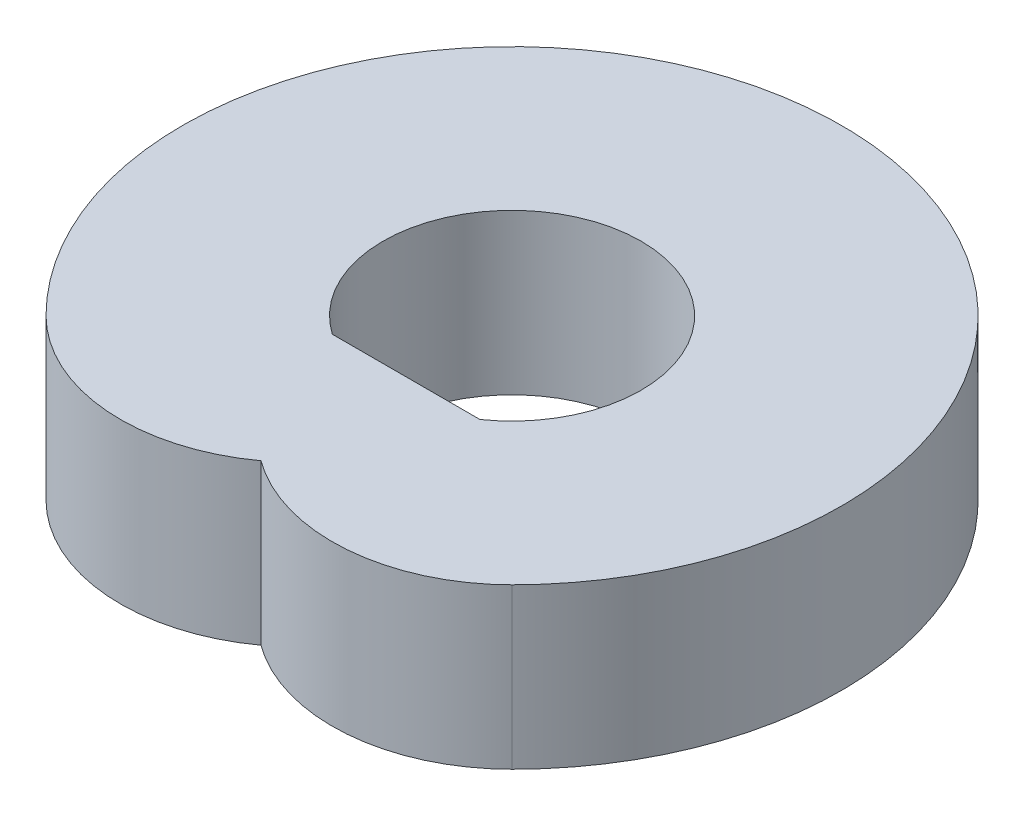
from build123d import *

# Parameters (mm, degrees)
EXTRUDE_1_DEPTH = 400


with BuildPart() as part:
    # Sketch 1 → Extrude 1 (new body)
    with BuildSketch(Plane(origin=(0, 0, 0), x_dir=(1, 0, 0), z_dir=(0, 1, 0))):
        with BuildLine():
            ThreePointArc((583.363094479, -583.363094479), (0, 825), (-583.363094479, -583.363094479))
            ThreePointArc((-583.363094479, -583.363094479), (-300.063671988, -713.809763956), (0, -628.741032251))
            ThreePointArc((0, -628.741032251), (300.063671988, -713.809763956), (583.363094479, -583.363094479))
        make_face()
        with BuildLine():
            Line((184.834957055, -265.165042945), (-184.834957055, -265.165042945))
            ThreePointArc((-184.834957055, -265.165042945), (0, 323.22818774), (184.834957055, -265.165042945))
        make_face(mode=Mode.SUBTRACT)
    extrude(amount=EXTRUDE_1_DEPTH)


solid = part.part
